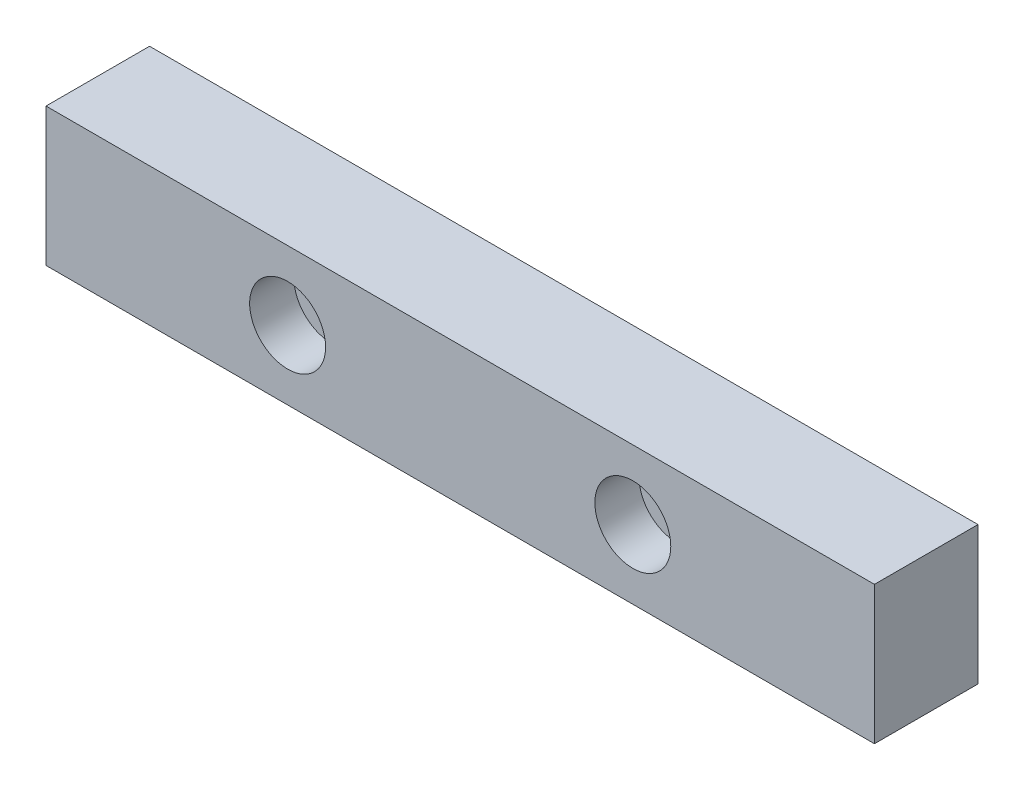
from build123d import *

# Parameters (mm, degrees)
ESQUISSE1_W                                        = 120
ESQUISSE1_H                                        = 20
BOSS_EXTRU_1_DEPTH                                 = 15
CHAMBRAGE_POUR_VIS_T_TE_HEXAGONALE_M61_D           = 6.6
CHAMBRAGE_POUR_VIS_T_TE_HEXAGONALE_M61_CBORE_D     = 11
CHAMBRAGE_POUR_VIS_T_TE_HEXAGONALE_M61_CBORE_DEPTH = 6.4


with BuildPart() as part:
    # Esquisse1 → Boss.-Extru.1 (new body)
    with BuildSketch(Plane.XY):
        with Locations((-60, 10)):
            Rectangle(ESQUISSE1_W, ESQUISSE1_H)
    extrude(amount=BOSS_EXTRU_1_DEPTH)

    # Chambrage pour vis _ t_te hexagonale M61 (through all)
    with Locations(Plane.XY.offset(15)):
        with Locations((-35, 10), (-85, 10)):
            CounterBoreHole(CHAMBRAGE_POUR_VIS_T_TE_HEXAGONALE_M61_D / 2, CHAMBRAGE_POUR_VIS_T_TE_HEXAGONALE_M61_CBORE_D / 2, CHAMBRAGE_POUR_VIS_T_TE_HEXAGONALE_M61_CBORE_DEPTH)


solid = part.part
